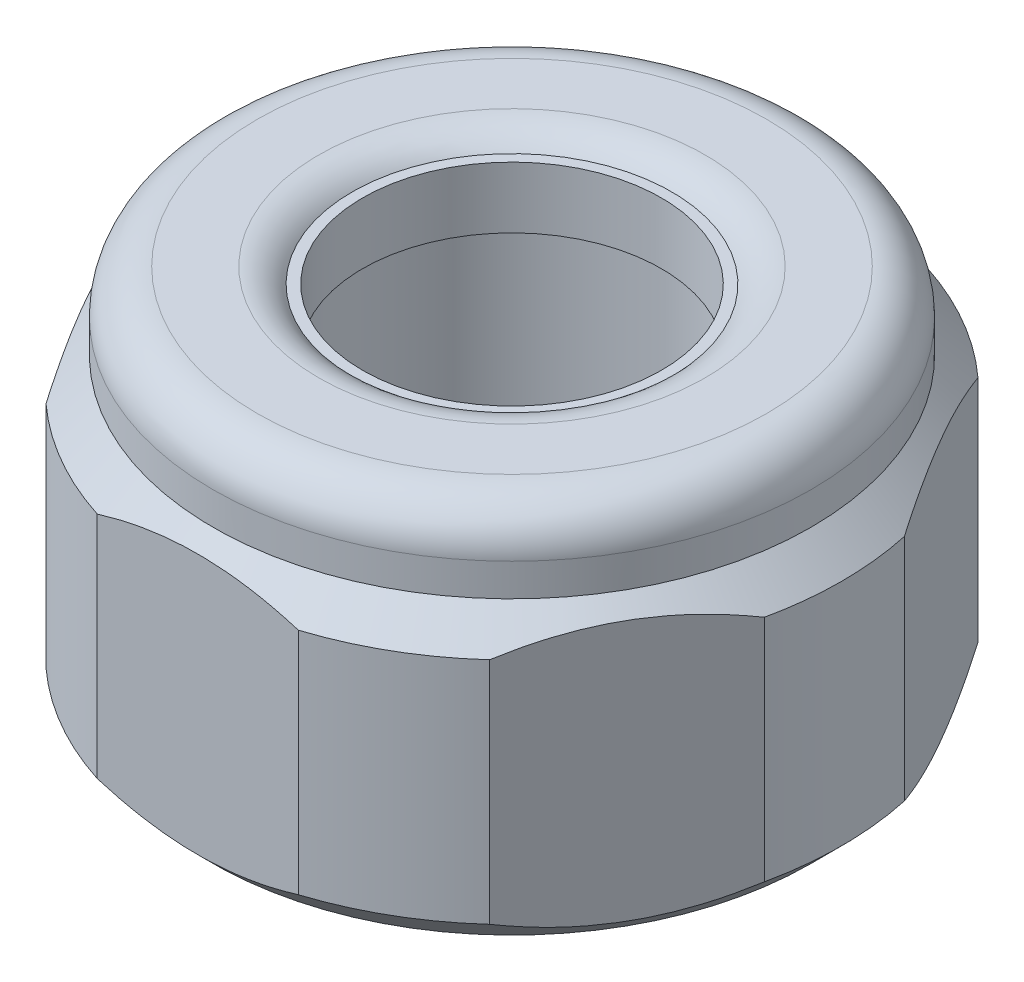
ISO-10303-21;
HEADER;
FILE_DESCRIPTION(('STEP AP214'),'2;1');
FILE_NAME('part.step','',(''),(''),'','','');
FILE_SCHEMA(('AUTOMOTIVE_DESIGN { 1 0 10303 214 1 1 1 1 }'));
ENDSEC;
DATA;
#1=APPLICATION_CONTEXT('core data for automotive mechanical design processes');
#2=APPLICATION_PROTOCOL_DEFINITION('international standard','automotive_design',2000,#1);
#3=PRODUCT_CONTEXT('',#1,'mechanical');
#4=PRODUCT('Part','Part','',(#3));
#5=PRODUCT_RELATED_PRODUCT_CATEGORY('part','',(#4));
#6=PRODUCT_DEFINITION_FORMATION('','',#4);
#7=PRODUCT_DEFINITION_CONTEXT('part definition',#1,'design');
#8=PRODUCT_DEFINITION('design','',#6,#7);
#9=PRODUCT_DEFINITION_SHAPE('','',#8);
#10=(LENGTH_UNIT() NAMED_UNIT(*) SI_UNIT(.MILLI.,.METRE.));
#11=(NAMED_UNIT(*) PLANE_ANGLE_UNIT() SI_UNIT($,.RADIAN.));
#12=(NAMED_UNIT(*) SI_UNIT($,.STERADIAN.) SOLID_ANGLE_UNIT());
#13=UNCERTAINTY_MEASURE_WITH_UNIT(LENGTH_MEASURE(1.E-05),#10,'distance_accuracy_value','');
#14=(GEOMETRIC_REPRESENTATION_CONTEXT(3) GLOBAL_UNCERTAINTY_ASSIGNED_CONTEXT((#13)) GLOBAL_UNIT_ASSIGNED_CONTEXT((#10,
#11,#12)) REPRESENTATION_CONTEXT('',''));
#15=CARTESIAN_POINT('',(0.,0.,0.));
#16=DIRECTION('',(0.,0.,1.));
#17=DIRECTION('',(1.,0.,0.));
#18=AXIS2_PLACEMENT_3D('',#15,#16,#17);
#19=CARTESIAN_POINT('',(0.,1.06572779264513,0.));
#20=DIRECTION('',(0.,-1.,0.));
#21=DIRECTION('',(1.,0.,0.));
#22=AXIS2_PLACEMENT_3D('',#19,#20,#21);
#23=CONICAL_SURFACE('',#22,4.73427220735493,0.785398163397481);
#24=CARTESIAN_POINT('',(0.,1.90000000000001,0.));
#25=DIRECTION('',(0.,-1.,0.));
#26=DIRECTION('',(1.,0.,0.));
#27=AXIS2_PLACEMENT_3D('',#24,#25,#26);
#28=CIRCLE('',#27,3.89999999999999);
#29=CARTESIAN_POINT('',(3.89999999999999,1.90000000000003,0.));
#30=VERTEX_POINT('',#29);
#31=EDGE_CURVE('E284',#30,#30,#28,.T.);
#32=ORIENTED_EDGE('',*,*,#31,.T.);
#33=EDGE_LOOP('',(#32));
#34=FACE_BOUND('',#33,.T.);
#35=CARTESIAN_POINT('',(4.73438767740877,1.06561231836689,0.000199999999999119));
#36=CARTESIAN_POINT('',(4.69368427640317,1.10631144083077,-0.0703003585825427));
#37=CARTESIAN_POINT('',(4.65266939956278,1.14576193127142,-0.141340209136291));
#38=CARTESIAN_POINT('',(4.56995253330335,1.22178504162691,-0.284610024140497));
#39=CARTESIAN_POINT('',(4.5282501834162,1.25835608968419,-0.356840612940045));
#40=CARTESIAN_POINT('',(4.4016281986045,1.36349105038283,-0.576156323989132));
#41=CARTESIAN_POINT('',(4.31563240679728,1.42702821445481,-0.725105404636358));
#42=CARTESIAN_POINT('',(4.14224862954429,1.53583888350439,-1.02541491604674));
#43=CARTESIAN_POINT('',(4.05490443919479,1.58138639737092,-1.17669949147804));
#44=CARTESIAN_POINT('',(3.87828737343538,1.65156787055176,-1.48260922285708));
#45=CARTESIAN_POINT('',(3.78901990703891,1.6762541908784,-1.6372250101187));
#46=CARTESIAN_POINT('',(3.63517080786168,1.69852708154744,-1.90369946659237));
#47=CARTESIAN_POINT('',(3.57078739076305,1.70182341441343,-2.0152148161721));
#48=CARTESIAN_POINT('',(3.44212505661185,1.69626668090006,-2.23806451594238));
#49=CARTESIAN_POINT('',(3.377846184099,1.68740935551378,-2.34939878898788));
#50=CARTESIAN_POINT('',(3.24989749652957,1.65805052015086,-2.57101241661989));
#51=CARTESIAN_POINT('',(3.18622844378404,1.63753598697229,-2.68129045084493));
#52=CARTESIAN_POINT('',(3.05998381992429,1.5859825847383,-2.89995255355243));
#53=CARTESIAN_POINT('',(2.99740816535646,1.55494452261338,-3.00833676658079));
#54=CARTESIAN_POINT('',(2.88632160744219,1.49108708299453,-3.20074432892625));
#55=CARTESIAN_POINT('',(2.83756475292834,1.45994671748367,-3.28519367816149));
#56=CARTESIAN_POINT('',(2.74092631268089,1.39264751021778,-3.45257636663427));
#57=CARTESIAN_POINT('',(2.69304475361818,1.35648851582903,-3.5355096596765));
#58=CARTESIAN_POINT('',(2.59830776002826,1.27996263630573,-3.69959894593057));
#59=CARTESIAN_POINT('',(2.55144963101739,1.23960898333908,-3.78075960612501));
#60=CARTESIAN_POINT('',(2.45860112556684,1.155223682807,-3.94157793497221));
#61=CARTESIAN_POINT('',(2.4126102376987,1.11119429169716,-4.02123648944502));
#62=CARTESIAN_POINT('',(2.36702063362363,1.06561231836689,-4.1002));
#63=B_SPLINE_CURVE_WITH_KNOTS('',3,(#35,#36,#37,#38,#39,#40,#41,#42,#43,#44,#45,#46,#47,#48,#49,
#50,#51,#52,#53,#54,#55,#56,#57,#58,#59,#60,#61,#62),.UNSPECIFIED.,.F.,.F.,(4,2,2,2,2,2,2,2,2,2,
2,2,2,4),(0.,0.273020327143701,0.546188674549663,1.09547485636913,1.63603822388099,
2.17524072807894,2.56112268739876,2.94713990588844,3.33358922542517,3.72000891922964,
4.02696073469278,4.33392188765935,4.63994253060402,4.94577667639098),.UNSPECIFIED.);
#64=CARTESIAN_POINT('',(4.20702438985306,1.49500000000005,-0.91322000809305));
#65=VERTEX_POINT('',#64);
#66=CARTESIAN_POINT('',(2.89438392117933,1.49500000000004,-3.18677999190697));
#67=VERTEX_POINT('',#66);
#68=EDGE_CURVE('E230',#65,#67,#63,.T.);
#69=ORIENTED_EDGE('',*,*,#68,.T.);
#70=CARTESIAN_POINT('',(0.,1.49500000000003,0.));
#71=DIRECTION('',(0.,-1.,0.));
#72=DIRECTION('',(1.,0.,0.));
#73=AXIS2_PLACEMENT_3D('',#70,#71,#72);
#74=CIRCLE('',#73,4.305);
#75=CARTESIAN_POINT('',(1.31264046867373,1.49500000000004,-4.1));
#76=VERTEX_POINT('',#75);
#77=EDGE_CURVE('E272',#67,#76,#74,.F.);
#78=ORIENTED_EDGE('',*,*,#77,.T.);
#79=CARTESIAN_POINT('',(-4.85965164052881,-0.558161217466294,-4.1));
#80=CARTESIAN_POINT('',(-4.74192837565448,-0.468203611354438,-4.1));
#81=CARTESIAN_POINT('',(-4.62356174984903,-0.379074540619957,-4.1));
#82=CARTESIAN_POINT('',(-4.38528211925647,-0.202849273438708,-4.1));
#83=CARTESIAN_POINT('',(-4.26536874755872,-0.115753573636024,-4.1));
#84=CARTESIAN_POINT('',(-4.02285896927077,0.0566490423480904,-4.1));
#85=CARTESIAN_POINT('',(-3.90024898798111,0.141936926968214,-4.1));
#86=CARTESIAN_POINT('',(-3.65297313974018,0.309468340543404,-4.1));
#87=CARTESIAN_POINT('',(-3.52830741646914,0.39171208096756,-4.1));
#88=CARTESIAN_POINT('',(-3.268890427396,0.557378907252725,-4.1));
#89=CARTESIAN_POINT('',(-3.13398834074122,0.640567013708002,-4.1));
#90=CARTESIAN_POINT('',(-2.86102203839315,0.801669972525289,-4.1));
#91=CARTESIAN_POINT('',(-2.72295730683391,0.879583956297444,-4.1));
#92=CARTESIAN_POINT('',(-2.44364631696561,1.02847130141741,-4.1));
#93=CARTESIAN_POINT('',(-2.30241101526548,1.09946505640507,-4.1));
#94=CARTESIAN_POINT('',(-2.01599787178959,1.23292169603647,-4.1));
#95=CARTESIAN_POINT('',(-1.87082190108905,1.29538854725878,-4.1));
#96=CARTESIAN_POINT('',(-1.58983505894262,1.4042751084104,-4.1));
#97=CARTESIAN_POINT('',(-1.45439563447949,1.45164354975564,-4.1));
#98=CARTESIAN_POINT('',(-1.18013478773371,1.53553167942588,-4.1));
#99=CARTESIAN_POINT('',(-1.04131314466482,1.57205065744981,-4.1));
#100=CARTESIAN_POINT('',(-0.76349423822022,1.63168098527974,-4.1));
#101=CARTESIAN_POINT('',(-0.624549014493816,1.65503076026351,-4.1));
#102=CARTESIAN_POINT('',(-0.345019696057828,1.68784725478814,-4.1));
#103=CARTESIAN_POINT('',(-0.20443592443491,1.6973166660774,-4.1));
#104=CARTESIAN_POINT('',(0.0712088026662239,1.70160309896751,-4.1));
#105=CARTESIAN_POINT('',(0.206260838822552,1.69700270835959,-4.1));
#106=CARTESIAN_POINT('',(0.475274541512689,1.67472344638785,-4.1));
#107=CARTESIAN_POINT('',(0.609236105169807,1.6570433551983,-4.1));
#108=CARTESIAN_POINT('',(0.877367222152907,1.60929098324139,-4.1));
#109=CARTESIAN_POINT('',(1.0114976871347,1.57900283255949,-4.1));
#110=CARTESIAN_POINT('',(1.27681712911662,1.50769083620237,-4.1));
#111=CARTESIAN_POINT('',(1.40800630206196,1.46666770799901,-4.1));
#112=CARTESIAN_POINT('',(1.67628366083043,1.37246643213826,-4.1));
#113=CARTESIAN_POINT('',(1.81314098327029,1.31863794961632,-4.1));
#114=CARTESIAN_POINT('',(2.0833244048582,1.20268139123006,-4.1));
#115=CARTESIAN_POINT('',(2.21664886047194,1.14054953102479,-4.1));
#116=CARTESIAN_POINT('',(2.48040337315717,1.00946107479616,-4.1));
#117=CARTESIAN_POINT('',(2.61082282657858,0.94048331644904,-4.1));
#118=CARTESIAN_POINT('',(2.86866911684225,0.797223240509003,-4.1));
#119=CARTESIAN_POINT('',(2.99609641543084,0.722941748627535,-4.1));
#120=CARTESIAN_POINT('',(3.24210976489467,0.573894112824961,-4.1));
#121=CARTESIAN_POINT('',(3.36082125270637,0.499333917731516,-4.1));
#122=CARTESIAN_POINT('',(3.59620511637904,0.347051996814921,-4.1));
#123=CARTESIAN_POINT('',(3.7128773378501,0.269330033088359,-4.1));
#124=CARTESIAN_POINT('',(3.94350868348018,0.111924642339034,-4.1));
#125=CARTESIAN_POINT('',(4.05748209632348,0.0322620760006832,-4.1));
#126=CARTESIAN_POINT('',(4.28386722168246,-0.129189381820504,-4.1));
#127=CARTESIAN_POINT('',(4.39627935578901,-0.210977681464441,-4.1));
#128=CARTESIAN_POINT('',(4.50803692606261,-0.293635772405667,-4.1));
#129=B_SPLINE_CURVE_WITH_KNOTS('',3,(#79,#80,#81,#82,#83,#84,#85,#86,#87,#88,#89,#90,#91,#92,
#93,#94,#95,#96,#97,#98,#99,#100,#101,#102,#103,#104,#105,#106,#107,#108,#109,#110,#111,#112,
#113,#114,#115,#116,#117,#118,#119,#120,#121,#122,#123,#124,#125,#126,#127,#128),.UNSPECIFIED.,
.F.,.F.,(4,2,2,2,2,2,2,2,2,2,2,2,2,2,2,2,2,2,2,2,2,2,2,2,4),(0.,0.444485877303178,
0.889079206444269,1.33710924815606,1.78510810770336,2.26047991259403,2.73592981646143,
3.20993330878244,3.6837155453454,4.11379352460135,4.543899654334,4.96594590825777,
5.38791030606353,5.79264233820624,6.19741212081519,6.60941745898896,7.0213952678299,
7.46224346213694,7.90329326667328,8.34575164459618,8.78814128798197,9.20863544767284,
9.62916130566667,10.0462974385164,10.4633186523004),.UNSPECIFIED.);
#130=CARTESIAN_POINT('',(-1.31264046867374,1.49500000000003,-4.1));
#131=VERTEX_POINT('',#130);
#132=EDGE_CURVE('E222',#76,#131,#129,.F.);
#133=ORIENTED_EDGE('',*,*,#132,.T.);
#134=CARTESIAN_POINT('',(-2.89438392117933,1.49500000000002,-3.18677999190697));
#135=VERTEX_POINT('',#134);
#136=EDGE_CURVE('E268',#131,#135,#74,.F.);
#137=ORIENTED_EDGE('',*,*,#136,.T.);
#138=CARTESIAN_POINT('',(-2.36702063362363,1.06561231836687,-4.1002));
#139=CARTESIAN_POINT('',(-2.40772403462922,1.10631144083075,-4.02969964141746));
#140=CARTESIAN_POINT('',(-2.44873891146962,1.1457619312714,-3.95865979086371));
#141=CARTESIAN_POINT('',(-2.53145577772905,1.22178504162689,-3.8153899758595));
#142=CARTESIAN_POINT('',(-2.57315812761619,1.25835608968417,-3.74315938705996));
#143=CARTESIAN_POINT('',(-2.6997801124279,1.36349105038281,-3.52384367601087));
#144=CARTESIAN_POINT('',(-2.78577590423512,1.42702821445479,-3.37489459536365));
#145=CARTESIAN_POINT('',(-2.95915968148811,1.53583888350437,-3.07458508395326));
#146=CARTESIAN_POINT('',(-3.04650387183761,1.5813863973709,-2.92330050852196));
#147=CARTESIAN_POINT('',(-3.22312093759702,1.65156787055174,-2.61739077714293));
#148=CARTESIAN_POINT('',(-3.31238840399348,1.67625419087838,-2.4627749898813));
#149=CARTESIAN_POINT('',(-3.46623750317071,1.69852708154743,-2.19630053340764));
#150=CARTESIAN_POINT('',(-3.53062092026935,1.70182341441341,-2.08478518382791));
#151=CARTESIAN_POINT('',(-3.65928325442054,1.69626668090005,-1.86193548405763));
#152=CARTESIAN_POINT('',(-3.7235621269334,1.68740935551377,-1.75060121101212));
#153=CARTESIAN_POINT('',(-3.85151081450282,1.65805052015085,-1.52898758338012));
#154=CARTESIAN_POINT('',(-3.91517986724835,1.63753598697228,-1.41870954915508));
#155=CARTESIAN_POINT('',(-4.0414244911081,1.58598258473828,-1.20004744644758));
#156=CARTESIAN_POINT('',(-4.10400014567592,1.55494452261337,-1.09166323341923));
#157=CARTESIAN_POINT('',(-4.2150867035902,1.49108708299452,-0.899255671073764));
#158=CARTESIAN_POINT('',(-4.26384355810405,1.45994671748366,-0.814806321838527));
#159=CARTESIAN_POINT('',(-4.36048199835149,1.39264751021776,-0.647423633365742));
#160=CARTESIAN_POINT('',(-4.40836355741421,1.35648851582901,-0.564490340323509));
#161=CARTESIAN_POINT('',(-4.50310055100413,1.27996263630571,-0.400401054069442));
#162=CARTESIAN_POINT('',(-4.549958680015,1.23960898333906,-0.319240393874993));
#163=CARTESIAN_POINT('',(-4.64280718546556,1.15522368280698,-0.158422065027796));
#164=CARTESIAN_POINT('',(-4.68879807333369,1.11119429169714,-0.0787635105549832));
#165=CARTESIAN_POINT('',(-4.73438767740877,1.06561231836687,0.000199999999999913));
#166=B_SPLINE_CURVE_WITH_KNOTS('',3,(#138,#139,#140,#141,#142,#143,#144,#145,#146,#147,#148,
#149,#150,#151,#152,#153,#154,#155,#156,#157,#158,#159,#160,#161,#162,#163,#164,#165),
.UNSPECIFIED.,.F.,.F.,(4,2,2,2,2,2,2,2,2,2,2,2,2,4),(0.,0.2730203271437,0.546188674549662,
1.09547485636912,1.63603822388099,2.17524072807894,2.56112268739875,2.94713990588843,
3.33358922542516,3.72000891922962,4.02696073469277,4.33392188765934,4.63994253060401,
4.94577667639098),.UNSPECIFIED.);
#167=CARTESIAN_POINT('',(-4.20702438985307,1.49500000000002,-0.913220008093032));
#168=VERTEX_POINT('',#167);
#169=EDGE_CURVE('E231',#135,#168,#166,.T.);
#170=ORIENTED_EDGE('',*,*,#169,.T.);
#171=CARTESIAN_POINT('',(-4.20702438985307,1.49500000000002,0.913220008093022));
#172=VERTEX_POINT('',#171);
#173=EDGE_CURVE('E58',#168,#172,#74,.F.);
#174=ORIENTED_EDGE('',*,*,#173,.T.);
#175=CARTESIAN_POINT('',(-4.73438767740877,1.06561231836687,-0.000200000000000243));
#176=CARTESIAN_POINT('',(-4.69368427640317,1.10631144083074,0.0703003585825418));
#177=CARTESIAN_POINT('',(-4.65266939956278,1.14576193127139,0.14134020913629));
#178=CARTESIAN_POINT('',(-4.56995253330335,1.22178504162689,0.284610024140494));
#179=CARTESIAN_POINT('',(-4.52825018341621,1.25835608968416,0.356840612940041));
#180=CARTESIAN_POINT('',(-4.4016281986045,1.36349105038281,0.576156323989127));
#181=CARTESIAN_POINT('',(-4.31563240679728,1.42702821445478,0.725105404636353));
#182=CARTESIAN_POINT('',(-4.14224862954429,1.53583888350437,1.02541491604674));
#183=CARTESIAN_POINT('',(-4.05490443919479,1.5813863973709,1.17669949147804));
#184=CARTESIAN_POINT('',(-3.87828737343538,1.65156787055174,1.48260922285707));
#185=CARTESIAN_POINT('',(-3.78901990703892,1.67625419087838,1.63722501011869));
#186=CARTESIAN_POINT('',(-3.63517080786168,1.69852708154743,1.90369946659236));
#187=CARTESIAN_POINT('',(-3.57078739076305,1.70182341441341,2.01521481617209));
#188=CARTESIAN_POINT('',(-3.44212505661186,1.69626668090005,2.23806451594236));
#189=CARTESIAN_POINT('',(-3.377846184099,1.68740935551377,2.34939878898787));
#190=CARTESIAN_POINT('',(-3.24989749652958,1.65805052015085,2.57101241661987));
#191=CARTESIAN_POINT('',(-3.18622844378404,1.63753598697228,2.68129045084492));
#192=CARTESIAN_POINT('',(-3.0599838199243,1.58598258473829,2.89995255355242));
#193=CARTESIAN_POINT('',(-2.99740816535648,1.55494452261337,3.00833676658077));
#194=CARTESIAN_POINT('',(-2.8863216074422,1.49108708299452,3.20074432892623));
#195=CARTESIAN_POINT('',(-2.83756475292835,1.45994671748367,3.28519367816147));
#196=CARTESIAN_POINT('',(-2.7409263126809,1.39264751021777,3.45257636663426));
#197=CARTESIAN_POINT('',(-2.69304475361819,1.35648851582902,3.53550965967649));
#198=CARTESIAN_POINT('',(-2.59830776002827,1.27996263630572,3.69959894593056));
#199=CARTESIAN_POINT('',(-2.5514496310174,1.23960898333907,3.78075960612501));
#200=CARTESIAN_POINT('',(-2.45860112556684,1.15522368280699,3.9415779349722));
#201=CARTESIAN_POINT('',(-2.41261023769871,1.11119429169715,4.02123648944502));
#202=CARTESIAN_POINT('',(-2.36702063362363,1.06561231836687,4.1002));
#203=B_SPLINE_CURVE_WITH_KNOTS('',3,(#175,#176,#177,#178,#179,#180,#181,#182,#183,#184,#185,
#186,#187,#188,#189,#190,#191,#192,#193,#194,#195,#196,#197,#198,#199,#200,#201,#202),
.UNSPECIFIED.,.F.,.F.,(4,2,2,2,2,2,2,2,2,2,2,2,2,4),(0.,0.2730203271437,0.546188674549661,
1.09547485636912,1.63603822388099,2.17524072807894,2.56112268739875,2.94713990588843,
3.33358922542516,3.72000891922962,4.02696073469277,4.33392188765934,4.63994253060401,
4.94577667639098),.UNSPECIFIED.);
#204=CARTESIAN_POINT('',(-2.89438392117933,1.49500000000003,3.18677999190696));
#205=VERTEX_POINT('',#204);
#206=EDGE_CURVE('E295',#172,#205,#203,.T.);
#207=ORIENTED_EDGE('',*,*,#206,.T.);
#208=CARTESIAN_POINT('',(-1.31264046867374,1.49500000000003,4.1));
#209=VERTEX_POINT('',#208);
#210=EDGE_CURVE('E50',#205,#209,#74,.F.);
#211=ORIENTED_EDGE('',*,*,#210,.T.);
#212=CARTESIAN_POINT('',(-4.8596516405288,-0.558161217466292,4.1));
#213=CARTESIAN_POINT('',(-4.74192837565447,-0.468203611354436,4.1));
#214=CARTESIAN_POINT('',(-4.62356174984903,-0.379074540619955,4.1));
#215=CARTESIAN_POINT('',(-4.38528211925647,-0.202849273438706,4.1));
#216=CARTESIAN_POINT('',(-4.26536874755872,-0.115753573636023,4.1));
#217=CARTESIAN_POINT('',(-4.02285896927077,0.0566490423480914,4.1));
#218=CARTESIAN_POINT('',(-3.90024898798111,0.141936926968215,4.1));
#219=CARTESIAN_POINT('',(-3.65297313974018,0.309468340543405,4.1));
#220=CARTESIAN_POINT('',(-3.52830741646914,0.39171208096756,4.1));
#221=CARTESIAN_POINT('',(-3.268890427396,0.557378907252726,4.1));
#222=CARTESIAN_POINT('',(-3.13398834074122,0.640567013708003,4.1));
#223=CARTESIAN_POINT('',(-2.86102203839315,0.80166997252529,4.1));
#224=CARTESIAN_POINT('',(-2.72295730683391,0.879583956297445,4.1));
#225=CARTESIAN_POINT('',(-2.44364631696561,1.02847130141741,4.1));
#226=CARTESIAN_POINT('',(-2.30241101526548,1.09946505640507,4.1));
#227=CARTESIAN_POINT('',(-2.01599787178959,1.23292169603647,4.1));
#228=CARTESIAN_POINT('',(-1.87082190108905,1.29538854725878,4.1));
#229=CARTESIAN_POINT('',(-1.58983505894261,1.4042751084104,4.1));
#230=CARTESIAN_POINT('',(-1.45439563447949,1.45164354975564,4.1));
#231=CARTESIAN_POINT('',(-1.18013478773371,1.53553167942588,4.1));
#232=CARTESIAN_POINT('',(-1.04131314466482,1.57205065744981,4.1));
#233=CARTESIAN_POINT('',(-0.763494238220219,1.63168098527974,4.1));
#234=CARTESIAN_POINT('',(-0.624549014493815,1.65503076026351,4.1));
#235=CARTESIAN_POINT('',(-0.345019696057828,1.68784725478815,4.1));
#236=CARTESIAN_POINT('',(-0.20443592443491,1.6973166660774,4.1));
#237=CARTESIAN_POINT('',(0.0712088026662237,1.70160309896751,4.1));
#238=CARTESIAN_POINT('',(0.206260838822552,1.69700270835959,4.1));
#239=CARTESIAN_POINT('',(0.475274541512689,1.67472344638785,4.1));
#240=CARTESIAN_POINT('',(0.609236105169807,1.6570433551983,4.1));
#241=CARTESIAN_POINT('',(0.877367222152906,1.6092909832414,4.1));
#242=CARTESIAN_POINT('',(1.0114976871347,1.57900283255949,4.1));
#243=CARTESIAN_POINT('',(1.27681712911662,1.50769083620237,4.1));
#244=CARTESIAN_POINT('',(1.40800630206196,1.46666770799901,4.1));
#245=CARTESIAN_POINT('',(1.67628366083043,1.37246643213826,4.1));
#246=CARTESIAN_POINT('',(1.81314098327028,1.31863794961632,4.1));
#247=CARTESIAN_POINT('',(2.08332440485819,1.20268139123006,4.1));
#248=CARTESIAN_POINT('',(2.21664886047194,1.1405495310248,4.1));
#249=CARTESIAN_POINT('',(2.48040337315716,1.00946107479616,4.1));
#250=CARTESIAN_POINT('',(2.61082282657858,0.940483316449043,4.1));
#251=CARTESIAN_POINT('',(2.86866911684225,0.797223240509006,4.1));
#252=CARTESIAN_POINT('',(2.99609641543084,0.722941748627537,4.1));
#253=CARTESIAN_POINT('',(3.24210976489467,0.573894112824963,4.1));
#254=CARTESIAN_POINT('',(3.36082125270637,0.499333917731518,4.1));
#255=CARTESIAN_POINT('',(3.59620511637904,0.347051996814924,4.1));
#256=CARTESIAN_POINT('',(3.7128773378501,0.269330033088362,4.1));
#257=CARTESIAN_POINT('',(3.94350868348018,0.111924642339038,4.1));
#258=CARTESIAN_POINT('',(4.05748209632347,0.0322620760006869,4.1));
#259=CARTESIAN_POINT('',(4.28386722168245,-0.1291893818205,4.1));
#260=CARTESIAN_POINT('',(4.396279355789,-0.210977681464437,4.1));
#261=CARTESIAN_POINT('',(4.5080369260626,-0.293635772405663,4.1));
#262=B_SPLINE_CURVE_WITH_KNOTS('',3,(#212,#213,#214,#215,#216,#217,#218,#219,#220,#221,#222,
#223,#224,#225,#226,#227,#228,#229,#230,#231,#232,#233,#234,#235,#236,#237,#238,#239,#240,#241,
#242,#243,#244,#245,#246,#247,#248,#249,#250,#251,#252,#253,#254,#255,#256,#257,#258,#259,#260,
#261),.UNSPECIFIED.,.F.,.F.,(4,2,2,2,2,2,2,2,2,2,2,2,2,2,2,2,2,2,2,2,2,2,2,2,4),(0.,
0.444485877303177,0.889079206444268,1.33710924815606,1.78510810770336,2.26047991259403,
2.73592981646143,3.20993330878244,3.6837155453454,4.11379352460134,4.543899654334,
4.96594590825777,5.38791030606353,5.79264233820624,6.19741212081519,6.60941745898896,
7.0213952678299,7.46224346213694,7.90329326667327,8.34575164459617,8.78814128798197,
9.20863544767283,9.62916130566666,10.0462974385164,10.4633186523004),.UNSPECIFIED.);
#263=CARTESIAN_POINT('',(1.31264046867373,1.49500000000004,4.1));
#264=VERTEX_POINT('',#263);
#265=EDGE_CURVE('E287',#209,#264,#262,.T.);
#266=ORIENTED_EDGE('',*,*,#265,.T.);
#267=CARTESIAN_POINT('',(2.89438392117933,1.49500000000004,3.18677999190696));
#268=VERTEX_POINT('',#267);
#269=EDGE_CURVE('E333',#264,#268,#74,.F.);
#270=ORIENTED_EDGE('',*,*,#269,.T.);
#271=CARTESIAN_POINT('',(2.36702063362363,1.06561231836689,4.1002));
#272=CARTESIAN_POINT('',(2.40772403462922,1.10631144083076,4.02969964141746));
#273=CARTESIAN_POINT('',(2.44873891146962,1.14576193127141,3.95865979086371));
#274=CARTESIAN_POINT('',(2.53145577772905,1.22178504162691,3.8153899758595));
#275=CARTESIAN_POINT('',(2.57315812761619,1.25835608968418,3.74315938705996));
#276=CARTESIAN_POINT('',(2.6997801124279,1.36349105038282,3.52384367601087));
#277=CARTESIAN_POINT('',(2.78577590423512,1.4270282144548,3.37489459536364));
#278=CARTESIAN_POINT('',(2.95915968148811,1.53583888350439,3.07458508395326));
#279=CARTESIAN_POINT('',(3.04650387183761,1.58138639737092,2.92330050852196));
#280=CARTESIAN_POINT('',(3.22312093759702,1.65156787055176,2.61739077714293));
#281=CARTESIAN_POINT('',(3.31238840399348,1.6762541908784,2.4627749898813));
#282=CARTESIAN_POINT('',(3.46623750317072,1.69852708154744,2.19630053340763));
#283=CARTESIAN_POINT('',(3.53062092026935,1.70182341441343,2.0847851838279));
#284=CARTESIAN_POINT('',(3.65928325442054,1.69626668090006,1.86193548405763));
#285=CARTESIAN_POINT('',(3.7235621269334,1.68740935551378,1.75060121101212));
#286=CARTESIAN_POINT('',(3.85151081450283,1.65805052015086,1.52898758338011));
#287=CARTESIAN_POINT('',(3.91517986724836,1.63753598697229,1.41870954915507));
#288=CARTESIAN_POINT('',(4.0414244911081,1.5859825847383,1.20004744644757));
#289=CARTESIAN_POINT('',(4.10400014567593,1.55494452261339,1.09166323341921));
#290=CARTESIAN_POINT('',(4.2150867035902,1.49108708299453,0.899255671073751));
#291=CARTESIAN_POINT('',(4.26384355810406,1.45994671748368,0.814806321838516));
#292=CARTESIAN_POINT('',(4.3604819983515,1.39264751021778,0.647423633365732));
#293=CARTESIAN_POINT('',(4.40836355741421,1.35648851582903,0.564490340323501));
#294=CARTESIAN_POINT('',(4.50310055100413,1.27996263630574,0.400401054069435));
#295=CARTESIAN_POINT('',(4.549958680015,1.23960898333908,0.319240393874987));
#296=CARTESIAN_POINT('',(4.64280718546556,1.15522368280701,0.158422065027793));
#297=CARTESIAN_POINT('',(4.68879807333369,1.11119429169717,0.0787635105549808));
#298=CARTESIAN_POINT('',(4.73438767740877,1.06561231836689,-0.000200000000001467));
#299=B_SPLINE_CURVE_WITH_KNOTS('',3,(#271,#272,#273,#274,#275,#276,#277,#278,#279,#280,#281,
#282,#283,#284,#285,#286,#287,#288,#289,#290,#291,#292,#293,#294,#295,#296,#297,#298),
.UNSPECIFIED.,.F.,.F.,(4,2,2,2,2,2,2,2,2,2,2,2,2,4),(0.,0.2730203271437,0.546188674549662,
1.09547485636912,1.63603822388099,2.17524072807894,2.56112268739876,2.94713990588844,
3.33358922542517,3.72000891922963,4.02696073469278,4.33392188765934,4.63994253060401,
4.94577667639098),.UNSPECIFIED.);
#300=CARTESIAN_POINT('',(4.20702438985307,1.49500000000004,0.913220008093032));
#301=VERTEX_POINT('',#300);
#302=EDGE_CURVE('E242',#268,#301,#299,.T.);
#303=ORIENTED_EDGE('',*,*,#302,.T.);
#304=EDGE_CURVE('E127',#301,#65,#74,.F.);
#305=ORIENTED_EDGE('',*,*,#304,.T.);
#306=EDGE_LOOP('',(#69,#78,#133,#137,#170,#174,#207,#211,#266,#270,#303,#305));
#307=FACE_BOUND('',#306,.T.);
#308=ADVANCED_FACE('F35',(#34,#307),#23,.T.);
#309=CARTESIAN_POINT('',(0.,-1.8999999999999,0.));
#310=DIRECTION('',(0.,1.,0.));
#311=DIRECTION('',(-1.,0.,0.));
#312=AXIS2_PLACEMENT_3D('',#309,#310,#311);
#313=CONICAL_SURFACE('',#312,3.90000000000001,0.785398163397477);
#314=CARTESIAN_POINT('',(0.,-1.8999999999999,0.));
#315=DIRECTION('',(0.,-1.,0.));
#316=DIRECTION('',(1.,0.,0.));
#317=AXIS2_PLACEMENT_3D('',#314,#315,#316);
#318=CIRCLE('',#317,3.90000000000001);
#319=CARTESIAN_POINT('',(3.90000000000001,-1.89999999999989,0.));
#320=VERTEX_POINT('',#319);
#321=EDGE_CURVE('E283',#320,#320,#318,.T.);
#322=ORIENTED_EDGE('',*,*,#321,.F.);
#323=EDGE_LOOP('',(#322));
#324=FACE_BOUND('',#323,.T.);
#325=CARTESIAN_POINT('',(-4.73438767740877,-1.06561231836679,0.00019999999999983));
#326=CARTESIAN_POINT('',(-4.69368427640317,-1.10631144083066,-0.0703003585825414));
#327=CARTESIAN_POINT('',(-4.65266939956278,-1.14576193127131,-0.141340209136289));
#328=CARTESIAN_POINT('',(-4.56995253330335,-1.22178504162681,-0.284610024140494));
#329=CARTESIAN_POINT('',(-4.52825018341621,-1.25835608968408,-0.356840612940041));
#330=CARTESIAN_POINT('',(-4.4016281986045,-1.36349105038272,-0.576156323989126));
#331=CARTESIAN_POINT('',(-4.31563240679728,-1.4270282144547,-0.725105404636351));
#332=CARTESIAN_POINT('',(-4.14224862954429,-1.53583888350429,-1.02541491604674));
#333=CARTESIAN_POINT('',(-4.05490443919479,-1.58138639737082,-1.17669949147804));
#334=CARTESIAN_POINT('',(-3.87828737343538,-1.65156787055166,-1.48260922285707));
#335=CARTESIAN_POINT('',(-3.78901990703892,-1.6762541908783,-1.63722501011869));
#336=CARTESIAN_POINT('',(-3.63517080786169,-1.69852708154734,-1.90369946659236));
#337=CARTESIAN_POINT('',(-3.57078739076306,-1.70182341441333,-2.01521481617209));
#338=CARTESIAN_POINT('',(-3.44212505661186,-1.69626668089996,-2.23806451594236));
#339=CARTESIAN_POINT('',(-3.37784618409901,-1.68740935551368,-2.34939878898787));
#340=CARTESIAN_POINT('',(-3.24989749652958,-1.65805052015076,-2.57101241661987));
#341=CARTESIAN_POINT('',(-3.18622844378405,-1.6375359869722,-2.68129045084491));
#342=CARTESIAN_POINT('',(-3.0599838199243,-1.5859825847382,-2.89995255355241));
#343=CARTESIAN_POINT('',(-2.99740816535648,-1.55494452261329,-3.00833676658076));
#344=CARTESIAN_POINT('',(-2.88632160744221,-1.49108708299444,-3.20074432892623));
#345=CARTESIAN_POINT('',(-2.83756475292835,-1.45994671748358,-3.28519367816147));
#346=CARTESIAN_POINT('',(-2.74092631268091,-1.39264751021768,-3.45257636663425));
#347=CARTESIAN_POINT('',(-2.69304475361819,-1.35648851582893,-3.53550965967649));
#348=CARTESIAN_POINT('',(-2.59830776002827,-1.27996263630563,-3.69959894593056));
#349=CARTESIAN_POINT('',(-2.5514496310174,-1.23960898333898,-3.780759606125));
#350=CARTESIAN_POINT('',(-2.45860112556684,-1.1552236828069,-3.9415779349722));
#351=CARTESIAN_POINT('',(-2.41261023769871,-1.11119429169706,-4.02123648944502));
#352=CARTESIAN_POINT('',(-2.36702063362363,-1.06561231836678,-4.1002));
#353=B_SPLINE_CURVE_WITH_KNOTS('',3,(#325,#326,#327,#328,#329,#330,#331,#332,#333,#334,#335,
#336,#337,#338,#339,#340,#341,#342,#343,#344,#345,#346,#347,#348,#349,#350,#351,#352),
.UNSPECIFIED.,.F.,.F.,(4,2,2,2,2,2,2,2,2,2,2,2,2,4),(0.,0.273020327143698,0.546188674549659,
1.09547485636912,1.63603822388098,2.17524072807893,2.56112268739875,2.94713990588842,
3.33358922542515,3.72000891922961,4.02696073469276,4.33392188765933,4.63994253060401,
4.94577667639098),.UNSPECIFIED.);
#354=CARTESIAN_POINT('',(-4.20702438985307,-1.49499999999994,-0.913220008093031));
#355=VERTEX_POINT('',#354);
#356=CARTESIAN_POINT('',(-2.89438392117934,-1.49499999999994,-3.18677999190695));
#357=VERTEX_POINT('',#356);
#358=EDGE_CURVE('E200',#355,#357,#353,.T.);
#359=ORIENTED_EDGE('',*,*,#358,.T.);
#360=CARTESIAN_POINT('',(0.,-1.49499999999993,0.));
#361=DIRECTION('',(0.,1.,0.));
#362=DIRECTION('',(-1.,0.,0.));
#363=AXIS2_PLACEMENT_3D('',#360,#361,#362);
#364=CIRCLE('',#363,4.305);
#365=CARTESIAN_POINT('',(-1.31264046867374,-1.49499999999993,-4.1));
#366=VERTEX_POINT('',#365);
#367=EDGE_CURVE('E257',#357,#366,#364,.F.);
#368=ORIENTED_EDGE('',*,*,#367,.T.);
#369=CARTESIAN_POINT('',(-4.85965164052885,0.558161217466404,-4.1));
#370=CARTESIAN_POINT('',(-4.74192837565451,0.468203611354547,-4.1));
#371=CARTESIAN_POINT('',(-4.62356174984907,0.379074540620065,-4.1));
#372=CARTESIAN_POINT('',(-4.38528211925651,0.202849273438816,-4.1));
#373=CARTESIAN_POINT('',(-4.26536874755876,0.115753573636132,-4.1));
#374=CARTESIAN_POINT('',(-4.0228589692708,-0.0566490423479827,-4.1));
#375=CARTESIAN_POINT('',(-3.90024898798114,-0.141936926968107,-4.1));
#376=CARTESIAN_POINT('',(-3.65297313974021,-0.309468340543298,-4.1));
#377=CARTESIAN_POINT('',(-3.52830741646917,-0.391712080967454,-4.1));
#378=CARTESIAN_POINT('',(-3.26889042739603,-0.557378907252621,-4.1));
#379=CARTESIAN_POINT('',(-3.13398834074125,-0.640567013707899,-4.1));
#380=CARTESIAN_POINT('',(-2.86102203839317,-0.801669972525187,-4.1));
#381=CARTESIAN_POINT('',(-2.72295730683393,-0.879583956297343,-4.1));
#382=CARTESIAN_POINT('',(-2.44364631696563,-1.02847130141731,-4.1));
#383=CARTESIAN_POINT('',(-2.30241101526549,-1.09946505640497,-4.1));
#384=CARTESIAN_POINT('',(-2.0159978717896,-1.23292169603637,-4.1));
#385=CARTESIAN_POINT('',(-1.87082190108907,-1.29538854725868,-4.1));
#386=CARTESIAN_POINT('',(-1.58983505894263,-1.4042751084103,-4.1));
#387=CARTESIAN_POINT('',(-1.45439563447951,-1.45164354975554,-4.1));
#388=CARTESIAN_POINT('',(-1.18013478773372,-1.53553167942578,-4.1));
#389=CARTESIAN_POINT('',(-1.04131314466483,-1.57205065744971,-4.1));
#390=CARTESIAN_POINT('',(-0.763494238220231,-1.63168098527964,-4.1));
#391=CARTESIAN_POINT('',(-0.624549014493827,-1.65503076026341,-4.1));
#392=CARTESIAN_POINT('',(-0.34501969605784,-1.68784725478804,-4.1));
#393=CARTESIAN_POINT('',(-0.204435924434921,-1.6973166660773,-4.1));
#394=CARTESIAN_POINT('',(0.0712088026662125,-1.70160309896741,-4.1));
#395=CARTESIAN_POINT('',(0.206260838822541,-1.69700270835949,-4.1));
#396=CARTESIAN_POINT('',(0.475274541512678,-1.67472344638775,-4.1));
#397=CARTESIAN_POINT('',(0.609236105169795,-1.6570433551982,-4.1));
#398=CARTESIAN_POINT('',(0.877367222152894,-1.60929098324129,-4.1));
#399=CARTESIAN_POINT('',(1.01149768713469,-1.57900283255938,-4.1));
#400=CARTESIAN_POINT('',(1.27681712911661,-1.50769083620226,-4.1));
#401=CARTESIAN_POINT('',(1.40800630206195,-1.4666677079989,-4.1));
#402=CARTESIAN_POINT('',(1.67628366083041,-1.37246643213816,-4.1));
#403=CARTESIAN_POINT('',(1.81314098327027,-1.31863794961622,-4.1));
#404=CARTESIAN_POINT('',(2.08332440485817,-1.20268139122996,-4.1));
#405=CARTESIAN_POINT('',(2.21664886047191,-1.14054953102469,-4.1));
#406=CARTESIAN_POINT('',(2.48040337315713,-1.00946107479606,-4.1));
#407=CARTESIAN_POINT('',(2.61082282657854,-0.940483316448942,-4.1));
#408=CARTESIAN_POINT('',(2.8686691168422,-0.797223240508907,-4.1));
#409=CARTESIAN_POINT('',(2.99609641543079,-0.722941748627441,-4.1));
#410=CARTESIAN_POINT('',(3.24210976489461,-0.573894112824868,-4.1));
#411=CARTESIAN_POINT('',(3.36082125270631,-0.499333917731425,-4.1));
#412=CARTESIAN_POINT('',(3.59620511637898,-0.347051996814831,-4.1));
#413=CARTESIAN_POINT('',(3.71287733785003,-0.26933003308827,-4.1));
#414=CARTESIAN_POINT('',(3.94350868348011,-0.111924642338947,-4.1));
#415=CARTESIAN_POINT('',(4.0574820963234,-0.032262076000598,-4.1));
#416=CARTESIAN_POINT('',(4.28386722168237,0.129189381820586,-4.1));
#417=CARTESIAN_POINT('',(4.39627935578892,0.210977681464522,-4.1));
#418=CARTESIAN_POINT('',(4.50803692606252,0.293635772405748,-4.1));
#419=B_SPLINE_CURVE_WITH_KNOTS('',3,(#369,#370,#371,#372,#373,#374,#375,#376,#377,#378,#379,
#380,#381,#382,#383,#384,#385,#386,#387,#388,#389,#390,#391,#392,#393,#394,#395,#396,#397,#398,
#399,#400,#401,#402,#403,#404,#405,#406,#407,#408,#409,#410,#411,#412,#413,#414,#415,#416,#417,
#418),.UNSPECIFIED.,.F.,.F.,(4,2,2,2,2,2,2,2,2,2,2,2,2,2,2,2,2,2,2,2,2,2,2,2,4),(0.,
0.444485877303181,0.889079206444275,1.33710924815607,1.78510810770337,2.26047991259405,
2.73592981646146,3.20993330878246,3.68371554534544,4.11379352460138,4.54389965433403,
4.96594590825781,5.38791030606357,5.79264233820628,6.19741212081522,6.60941745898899,
7.02139526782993,7.46224346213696,7.90329326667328,8.34575164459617,8.78814128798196,
9.20863544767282,9.62916130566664,10.0462974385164,10.4633186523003),.UNSPECIFIED.);
#420=CARTESIAN_POINT('',(1.31264046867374,-1.49499999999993,-4.1));
#421=VERTEX_POINT('',#420);
#422=EDGE_CURVE('E153',#366,#421,#419,.T.);
#423=ORIENTED_EDGE('',*,*,#422,.T.);
#424=CARTESIAN_POINT('',(2.89438392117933,-1.49499999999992,-3.18677999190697));
#425=VERTEX_POINT('',#424);
#426=EDGE_CURVE('E330',#421,#425,#364,.F.);
#427=ORIENTED_EDGE('',*,*,#426,.T.);
#428=CARTESIAN_POINT('',(2.36702063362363,-1.06561231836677,-4.1002));
#429=CARTESIAN_POINT('',(2.40772403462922,-1.10631144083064,-4.02969964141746));
#430=CARTESIAN_POINT('',(2.44873891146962,-1.14576193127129,-3.95865979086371));
#431=CARTESIAN_POINT('',(2.53145577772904,-1.22178504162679,-3.81538997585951));
#432=CARTESIAN_POINT('',(2.57315812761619,-1.25835608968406,-3.74315938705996));
#433=CARTESIAN_POINT('',(2.69978011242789,-1.36349105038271,-3.52384367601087));
#434=CARTESIAN_POINT('',(2.78577590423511,-1.42702821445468,-3.37489459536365));
#435=CARTESIAN_POINT('',(2.9591596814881,-1.53583888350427,-3.07458508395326));
#436=CARTESIAN_POINT('',(3.0465038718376,-1.5813863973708,-2.92330050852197));
#437=CARTESIAN_POINT('',(3.22312093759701,-1.65156787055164,-2.61739077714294));
#438=CARTESIAN_POINT('',(3.31238840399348,-1.67625419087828,-2.46277498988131));
#439=CARTESIAN_POINT('',(3.46623750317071,-1.69852708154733,-2.19630053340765));
#440=CARTESIAN_POINT('',(3.53062092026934,-1.70182341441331,-2.08478518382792));
#441=CARTESIAN_POINT('',(3.65928325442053,-1.69626668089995,-1.86193548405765));
#442=CARTESIAN_POINT('',(3.72356212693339,-1.68740935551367,-1.75060121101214));
#443=CARTESIAN_POINT('',(3.85151081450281,-1.65805052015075,-1.52898758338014));
#444=CARTESIAN_POINT('',(3.91517986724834,-1.63753598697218,-1.4187095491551));
#445=CARTESIAN_POINT('',(4.04142449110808,-1.58598258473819,-1.2000474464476));
#446=CARTESIAN_POINT('',(4.10400014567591,-1.55494452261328,-1.09166323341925));
#447=CARTESIAN_POINT('',(4.21508670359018,-1.49108708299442,-0.899255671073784));
#448=CARTESIAN_POINT('',(4.26384355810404,-1.45994671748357,-0.814806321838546));
#449=CARTESIAN_POINT('',(4.36048199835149,-1.39264751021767,-0.647423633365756));
#450=CARTESIAN_POINT('',(4.4083635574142,-1.35648851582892,-0.564490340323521));
#451=CARTESIAN_POINT('',(4.50310055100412,-1.27996263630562,-0.40040105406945));
#452=CARTESIAN_POINT('',(4.549958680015,-1.23960898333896,-0.319240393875));
#453=CARTESIAN_POINT('',(4.64280718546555,-1.15522368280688,-0.158422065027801));
#454=CARTESIAN_POINT('',(4.68879807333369,-1.11119429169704,-0.0787635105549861));
#455=CARTESIAN_POINT('',(4.73438767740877,-1.06561231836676,0.000199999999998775));
#456=B_SPLINE_CURVE_WITH_KNOTS('',3,(#428,#429,#430,#431,#432,#433,#434,#435,#436,#437,#438,
#439,#440,#441,#442,#443,#444,#445,#446,#447,#448,#449,#450,#451,#452,#453,#454,#455),
.UNSPECIFIED.,.F.,.F.,(4,2,2,2,2,2,2,2,2,2,2,2,2,4),(0.,0.273020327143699,0.546188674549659,
1.09547485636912,1.63603822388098,2.17524072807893,2.56112268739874,2.94713990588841,
3.33358922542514,3.7200089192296,4.02696073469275,4.33392188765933,4.63994253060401,
4.94577667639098),.UNSPECIFIED.);
#457=CARTESIAN_POINT('',(4.20702438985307,-1.49499999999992,-0.913220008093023));
#458=VERTEX_POINT('',#457);
#459=EDGE_CURVE('E142',#425,#458,#456,.T.);
#460=ORIENTED_EDGE('',*,*,#459,.T.);
#461=CARTESIAN_POINT('',(4.20702438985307,-1.49499999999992,0.913220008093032));
#462=VERTEX_POINT('',#461);
#463=EDGE_CURVE('E124',#458,#462,#364,.F.);
#464=ORIENTED_EDGE('',*,*,#463,.T.);
#465=CARTESIAN_POINT('',(4.73438767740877,-1.06561231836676,-0.000200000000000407));
#466=CARTESIAN_POINT('',(4.69368427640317,-1.10631144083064,0.0703003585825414));
#467=CARTESIAN_POINT('',(4.65266939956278,-1.14576193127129,0.141340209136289));
#468=CARTESIAN_POINT('',(4.56995253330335,-1.22178504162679,0.284610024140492));
#469=CARTESIAN_POINT('',(4.52825018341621,-1.25835608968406,0.356840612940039));
#470=CARTESIAN_POINT('',(4.4016281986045,-1.3634910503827,0.576156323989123));
#471=CARTESIAN_POINT('',(4.31563240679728,-1.42702821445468,0.725105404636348));
#472=CARTESIAN_POINT('',(4.14224862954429,-1.53583888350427,1.02541491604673));
#473=CARTESIAN_POINT('',(4.05490443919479,-1.5813863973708,1.17669949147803));
#474=CARTESIAN_POINT('',(3.87828737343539,-1.65156787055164,1.48260922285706));
#475=CARTESIAN_POINT('',(3.78901990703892,-1.67625419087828,1.63722501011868));
#476=CARTESIAN_POINT('',(3.63517080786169,-1.69852708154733,1.90369946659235));
#477=CARTESIAN_POINT('',(3.57078739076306,-1.70182341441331,2.01521481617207));
#478=CARTESIAN_POINT('',(3.44212505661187,-1.69626668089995,2.23806451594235));
#479=CARTESIAN_POINT('',(3.37784618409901,-1.68740935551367,2.34939878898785));
#480=CARTESIAN_POINT('',(3.24989749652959,-1.65805052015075,2.57101241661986));
#481=CARTESIAN_POINT('',(3.18622844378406,-1.63753598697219,2.6812904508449));
#482=CARTESIAN_POINT('',(3.05998381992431,-1.58598258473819,2.89995255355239));
#483=CARTESIAN_POINT('',(2.99740816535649,-1.55494452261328,3.00833676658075));
#484=CARTESIAN_POINT('',(2.88632160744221,-1.49108708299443,3.20074432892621));
#485=CARTESIAN_POINT('',(2.83756475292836,-1.45994671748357,3.28519367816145));
#486=CARTESIAN_POINT('',(2.74092631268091,-1.39264751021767,3.45257636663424));
#487=CARTESIAN_POINT('',(2.6930447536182,-1.35648851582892,3.53550965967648));
#488=CARTESIAN_POINT('',(2.59830776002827,-1.27996263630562,3.69959894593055));
#489=CARTESIAN_POINT('',(2.5514496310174,-1.23960898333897,3.780759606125));
#490=CARTESIAN_POINT('',(2.45860112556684,-1.15522368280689,3.9415779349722));
#491=CARTESIAN_POINT('',(2.41261023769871,-1.11119429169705,4.02123648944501));
#492=CARTESIAN_POINT('',(2.36702063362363,-1.06561231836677,4.1002));
#493=B_SPLINE_CURVE_WITH_KNOTS('',3,(#465,#466,#467,#468,#469,#470,#471,#472,#473,#474,#475,
#476,#477,#478,#479,#480,#481,#482,#483,#484,#485,#486,#487,#488,#489,#490,#491,#492),
.UNSPECIFIED.,.F.,.F.,(4,2,2,2,2,2,2,2,2,2,2,2,2,4),(0.,0.273020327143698,0.546188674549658,
1.09547485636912,1.63603822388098,2.17524072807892,2.56112268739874,2.94713990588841,
3.33358922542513,3.72000891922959,4.02696073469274,4.33392188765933,4.63994253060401,
4.94577667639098),.UNSPECIFIED.);
#494=CARTESIAN_POINT('',(2.89438392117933,-1.49499999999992,3.18677999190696));
#495=VERTEX_POINT('',#494);
#496=EDGE_CURVE('E139',#462,#495,#493,.T.);
#497=ORIENTED_EDGE('',*,*,#496,.T.);
#498=CARTESIAN_POINT('',(1.31264046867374,-1.49499999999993,4.1));
#499=VERTEX_POINT('',#498);
#500=EDGE_CURVE('E145',#495,#499,#364,.F.);
#501=ORIENTED_EDGE('',*,*,#500,.T.);
#502=CARTESIAN_POINT('',(-4.85965164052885,0.558161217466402,4.1));
#503=CARTESIAN_POINT('',(-4.74192837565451,0.468203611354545,4.1));
#504=CARTESIAN_POINT('',(-4.62356174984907,0.379074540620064,4.1));
#505=CARTESIAN_POINT('',(-4.3852821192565,0.202849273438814,4.1));
#506=CARTESIAN_POINT('',(-4.26536874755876,0.115753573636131,4.1));
#507=CARTESIAN_POINT('',(-4.0228589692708,-0.0566490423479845,4.1));
#508=CARTESIAN_POINT('',(-3.90024898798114,-0.141936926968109,4.1));
#509=CARTESIAN_POINT('',(-3.65297313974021,-0.309468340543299,4.1));
#510=CARTESIAN_POINT('',(-3.52830741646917,-0.391712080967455,4.1));
#511=CARTESIAN_POINT('',(-3.26889042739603,-0.557378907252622,4.1));
#512=CARTESIAN_POINT('',(-3.13398834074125,-0.640567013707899,4.1));
#513=CARTESIAN_POINT('',(-2.86102203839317,-0.801669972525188,4.1));
#514=CARTESIAN_POINT('',(-2.72295730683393,-0.879583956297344,4.1));
#515=CARTESIAN_POINT('',(-2.44364631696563,-1.02847130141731,4.1));
#516=CARTESIAN_POINT('',(-2.30241101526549,-1.09946505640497,4.1));
#517=CARTESIAN_POINT('',(-2.0159978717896,-1.23292169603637,4.1));
#518=CARTESIAN_POINT('',(-1.87082190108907,-1.29538854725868,4.1));
#519=CARTESIAN_POINT('',(-1.58983505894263,-1.4042751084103,4.1));
#520=CARTESIAN_POINT('',(-1.45439563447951,-1.45164354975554,4.1));
#521=CARTESIAN_POINT('',(-1.18013478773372,-1.53553167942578,4.1));
#522=CARTESIAN_POINT('',(-1.04131314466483,-1.57205065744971,4.1));
#523=CARTESIAN_POINT('',(-0.76349423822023,-1.63168098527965,4.1));
#524=CARTESIAN_POINT('',(-0.624549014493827,-1.65503076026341,4.1));
#525=CARTESIAN_POINT('',(-0.345019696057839,-1.68784725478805,4.1));
#526=CARTESIAN_POINT('',(-0.204435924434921,-1.6973166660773,4.1));
#527=CARTESIAN_POINT('',(0.071208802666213,-1.70160309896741,4.1));
#528=CARTESIAN_POINT('',(0.206260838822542,-1.69700270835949,4.1));
#529=CARTESIAN_POINT('',(0.475274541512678,-1.67472344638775,4.1));
#530=CARTESIAN_POINT('',(0.609236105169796,-1.6570433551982,4.1));
#531=CARTESIAN_POINT('',(0.877367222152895,-1.60929098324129,4.1));
#532=CARTESIAN_POINT('',(1.01149768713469,-1.57900283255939,4.1));
#533=CARTESIAN_POINT('',(1.27681712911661,-1.50769083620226,4.1));
#534=CARTESIAN_POINT('',(1.40800630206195,-1.4666677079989,4.1));
#535=CARTESIAN_POINT('',(1.67628366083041,-1.37246643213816,4.1));
#536=CARTESIAN_POINT('',(1.81314098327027,-1.31863794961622,4.1));
#537=CARTESIAN_POINT('',(2.08332440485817,-1.20268139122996,4.1));
#538=CARTESIAN_POINT('',(2.21664886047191,-1.14054953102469,4.1));
#539=CARTESIAN_POINT('',(2.48040337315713,-1.00946107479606,4.1));
#540=CARTESIAN_POINT('',(2.61082282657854,-0.940483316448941,4.1));
#541=CARTESIAN_POINT('',(2.86866911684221,-0.797223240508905,4.1));
#542=CARTESIAN_POINT('',(2.9960964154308,-0.722941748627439,4.1));
#543=CARTESIAN_POINT('',(3.24210976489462,-0.573894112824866,4.1));
#544=CARTESIAN_POINT('',(3.36082125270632,-0.499333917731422,4.1));
#545=CARTESIAN_POINT('',(3.59620511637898,-0.347051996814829,4.1));
#546=CARTESIAN_POINT('',(3.71287733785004,-0.269330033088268,4.1));
#547=CARTESIAN_POINT('',(3.94350868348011,-0.111924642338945,4.1));
#548=CARTESIAN_POINT('',(4.0574820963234,-0.0322620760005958,4.1));
#549=CARTESIAN_POINT('',(4.28386722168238,0.129189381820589,4.1));
#550=CARTESIAN_POINT('',(4.39627935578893,0.210977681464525,4.1));
#551=CARTESIAN_POINT('',(4.50803692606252,0.293635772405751,4.1));
#552=B_SPLINE_CURVE_WITH_KNOTS('',3,(#502,#503,#504,#505,#506,#507,#508,#509,#510,#511,#512,
#513,#514,#515,#516,#517,#518,#519,#520,#521,#522,#523,#524,#525,#526,#527,#528,#529,#530,#531,
#532,#533,#534,#535,#536,#537,#538,#539,#540,#541,#542,#543,#544,#545,#546,#547,#548,#549,#550,
#551),.UNSPECIFIED.,.F.,.F.,(4,2,2,2,2,2,2,2,2,2,2,2,2,2,2,2,2,2,2,2,2,2,2,2,4),(0.,
0.444485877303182,0.889079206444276,1.33710924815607,1.78510810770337,2.26047991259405,
2.73592981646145,3.20993330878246,3.68371554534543,4.11379352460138,4.54389965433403,
4.96594590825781,5.38791030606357,5.79264233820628,6.19741212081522,6.60941745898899,
7.02139526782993,7.46224346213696,7.90329326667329,8.34575164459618,8.78814128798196,
9.20863544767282,9.62916130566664,10.0462974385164,10.4633186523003),.UNSPECIFIED.);
#553=CARTESIAN_POINT('',(-1.31264046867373,-1.49499999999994,4.1));
#554=VERTEX_POINT('',#553);
#555=EDGE_CURVE('E182',#499,#554,#552,.F.);
#556=ORIENTED_EDGE('',*,*,#555,.T.);
#557=CARTESIAN_POINT('',(-2.89438392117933,-1.49499999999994,3.18677999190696));
#558=VERTEX_POINT('',#557);
#559=EDGE_CURVE('E144',#554,#558,#364,.F.);
#560=ORIENTED_EDGE('',*,*,#559,.T.);
#561=CARTESIAN_POINT('',(-2.36702063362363,-1.06561231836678,4.1002));
#562=CARTESIAN_POINT('',(-2.40772403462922,-1.10631144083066,4.02969964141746));
#563=CARTESIAN_POINT('',(-2.44873891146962,-1.14576193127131,3.95865979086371));
#564=CARTESIAN_POINT('',(-2.53145577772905,-1.2217850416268,3.81538997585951));
#565=CARTESIAN_POINT('',(-2.57315812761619,-1.25835608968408,3.74315938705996));
#566=CARTESIAN_POINT('',(-2.69978011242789,-1.36349105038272,3.52384367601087));
#567=CARTESIAN_POINT('',(-2.78577590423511,-1.4270282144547,3.37489459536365));
#568=CARTESIAN_POINT('',(-2.95915968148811,-1.53583888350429,3.07458508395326));
#569=CARTESIAN_POINT('',(-3.0465038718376,-1.58138639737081,2.92330050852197));
#570=CARTESIAN_POINT('',(-3.22312093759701,-1.65156787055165,2.61739077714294));
#571=CARTESIAN_POINT('',(-3.31238840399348,-1.6762541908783,2.46277498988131));
#572=CARTESIAN_POINT('',(-3.46623750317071,-1.69852708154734,2.19630053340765));
#573=CARTESIAN_POINT('',(-3.53062092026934,-1.70182341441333,2.08478518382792));
#574=CARTESIAN_POINT('',(-3.65928325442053,-1.69626668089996,1.86193548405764));
#575=CARTESIAN_POINT('',(-3.72356212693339,-1.68740935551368,1.75060121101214));
#576=CARTESIAN_POINT('',(-3.85151081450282,-1.65805052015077,1.52898758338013));
#577=CARTESIAN_POINT('',(-3.91517986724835,-1.6375359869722,1.41870954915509));
#578=CARTESIAN_POINT('',(-4.04142449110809,-1.5859825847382,1.20004744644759));
#579=CARTESIAN_POINT('',(-4.10400014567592,-1.55494452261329,1.09166323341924));
#580=CARTESIAN_POINT('',(-4.21508670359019,-1.49108708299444,0.899255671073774));
#581=CARTESIAN_POINT('',(-4.26384355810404,-1.45994671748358,0.814806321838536));
#582=CARTESIAN_POINT('',(-4.36048199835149,-1.39264751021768,0.647423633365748));
#583=CARTESIAN_POINT('',(-4.40836355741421,-1.35648851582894,0.564490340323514));
#584=CARTESIAN_POINT('',(-4.50310055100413,-1.27996263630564,0.400401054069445));
#585=CARTESIAN_POINT('',(-4.549958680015,-1.23960898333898,0.319240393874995));
#586=CARTESIAN_POINT('',(-4.64280718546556,-1.15522368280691,0.158422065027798));
#587=CARTESIAN_POINT('',(-4.68879807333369,-1.11119429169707,0.0787635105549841));
#588=CARTESIAN_POINT('',(-4.73438767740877,-1.06561231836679,-0.000200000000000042));
#589=B_SPLINE_CURVE_WITH_KNOTS('',3,(#561,#562,#563,#564,#565,#566,#567,#568,#569,#570,#571,
#572,#573,#574,#575,#576,#577,#578,#579,#580,#581,#582,#583,#584,#585,#586,#587,#588),
.UNSPECIFIED.,.F.,.F.,(4,2,2,2,2,2,2,2,2,2,2,2,2,4),(0.,0.273020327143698,0.546188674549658,
1.09547485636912,1.63603822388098,2.17524072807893,2.56112268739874,2.94713990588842,
3.33358922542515,3.72000891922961,4.02696073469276,4.33392188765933,4.63994253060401,
4.94577667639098),.UNSPECIFIED.);
#590=CARTESIAN_POINT('',(-4.20702438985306,-1.49499999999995,0.91322000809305));
#591=VERTEX_POINT('',#590);
#592=EDGE_CURVE('E192',#558,#591,#589,.T.);
#593=ORIENTED_EDGE('',*,*,#592,.T.);
#594=EDGE_CURVE('E259',#591,#355,#364,.F.);
#595=ORIENTED_EDGE('',*,*,#594,.T.);
#596=EDGE_LOOP('',(#359,#368,#423,#427,#460,#464,#497,#501,#556,#560,#593,#595));
#597=FACE_BOUND('',#596,.T.);
#598=ADVANCED_FACE('F137',(#324,#597),#313,.T.);
#599=CARTESIAN_POINT('',(-2.36713610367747,1.9,4.1));
#600=DIRECTION('',(0.,0.,-1.));
#601=DIRECTION('',(-1.,0.,0.));
#602=AXIS2_PLACEMENT_3D('',#599,#600,#601);
#603=PLANE('',#602);
#604=DIRECTION('',(0.,1.,0.));
#605=VECTOR('',#604,1.);
#606=CARTESIAN_POINT('',(-1.31264046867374,-1.9,4.1));
#607=LINE('',#606,#605);
#608=EDGE_CURVE('E281',#554,#209,#607,.T.);
#609=ORIENTED_EDGE('',*,*,#608,.F.);
#610=ORIENTED_EDGE('',*,*,#555,.F.);
#611=DIRECTION('',(0.,1.,0.));
#612=VECTOR('',#611,1.);
#613=CARTESIAN_POINT('',(1.31264046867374,-1.9,4.1));
#614=LINE('',#613,#612);
#615=EDGE_CURVE('E331',#264,#499,#614,.F.);
#616=ORIENTED_EDGE('',*,*,#615,.F.);
#617=ORIENTED_EDGE('',*,*,#265,.F.);
#618=EDGE_LOOP('',(#609,#610,#616,#617));
#619=FACE_BOUND('',#618,.T.);
#620=ADVANCED_FACE('F173',(#619),#603,.F.);
#621=CARTESIAN_POINT('',(-4.73427220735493,1.9,0.));
#622=DIRECTION('',(0.866025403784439,0.,-0.5));
#623=DIRECTION('',(-0.5,0.,-0.866025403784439));
#624=AXIS2_PLACEMENT_3D('',#621,#622,#623);
#625=PLANE('',#624);
#626=DIRECTION('',(0.,1.,0.));
#627=VECTOR('',#626,1.);
#628=CARTESIAN_POINT('',(-4.20702438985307,-1.9,0.913220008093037));
#629=LINE('',#628,#627);
#630=EDGE_CURVE('E277',#591,#172,#629,.T.);
#631=ORIENTED_EDGE('',*,*,#630,.F.);
#632=ORIENTED_EDGE('',*,*,#592,.F.);
#633=DIRECTION('',(0.,1.,0.));
#634=VECTOR('',#633,1.);
#635=CARTESIAN_POINT('',(-2.89438392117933,-1.9,3.18677999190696));
#636=LINE('',#635,#634);
#637=EDGE_CURVE('E279',#205,#558,#636,.F.);
#638=ORIENTED_EDGE('',*,*,#637,.F.);
#639=ORIENTED_EDGE('',*,*,#206,.F.);
#640=EDGE_LOOP('',(#631,#632,#638,#639));
#641=FACE_BOUND('',#640,.T.);
#642=ADVANCED_FACE('F303',(#641),#625,.F.);
#643=CARTESIAN_POINT('',(-2.36713610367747,1.9,-4.1));
#644=DIRECTION('',(0.866025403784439,0.,0.5));
#645=DIRECTION('',(0.5,0.,-0.866025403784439));
#646=AXIS2_PLACEMENT_3D('',#643,#644,#645);
#647=PLANE('',#646);
#648=DIRECTION('',(0.,1.,0.));
#649=VECTOR('',#648,1.);
#650=CARTESIAN_POINT('',(-2.89438392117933,-1.9,-3.18677999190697));
#651=LINE('',#650,#649);
#652=EDGE_CURVE('E265',#357,#135,#651,.T.);
#653=ORIENTED_EDGE('',*,*,#652,.F.);
#654=ORIENTED_EDGE('',*,*,#358,.F.);
#655=DIRECTION('',(0.,1.,0.));
#656=VECTOR('',#655,1.);
#657=CARTESIAN_POINT('',(-4.20702438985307,-1.9,-0.913220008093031));
#658=LINE('',#657,#656);
#659=EDGE_CURVE('E263',#168,#355,#658,.F.);
#660=ORIENTED_EDGE('',*,*,#659,.F.);
#661=ORIENTED_EDGE('',*,*,#169,.F.);
#662=EDGE_LOOP('',(#653,#654,#660,#661));
#663=FACE_BOUND('',#662,.T.);
#664=ADVANCED_FACE('F216',(#663),#647,.F.);
#665=CARTESIAN_POINT('',(2.36713610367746,1.9,-4.1));
#666=DIRECTION('',(0.,0.,1.));
#667=DIRECTION('',(1.,0.,0.));
#668=AXIS2_PLACEMENT_3D('',#665,#666,#667);
#669=PLANE('',#668);
#670=DIRECTION('',(0.,1.,0.));
#671=VECTOR('',#670,1.);
#672=CARTESIAN_POINT('',(1.31264046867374,-1.9,-4.1));
#673=LINE('',#672,#671);
#674=EDGE_CURVE('E336',#421,#76,#673,.T.);
#675=ORIENTED_EDGE('',*,*,#674,.F.);
#676=ORIENTED_EDGE('',*,*,#422,.F.);
#677=DIRECTION('',(0.,1.,0.));
#678=VECTOR('',#677,1.);
#679=CARTESIAN_POINT('',(-1.31264046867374,-1.9,-4.1));
#680=LINE('',#679,#678);
#681=EDGE_CURVE('E274',#131,#366,#680,.F.);
#682=ORIENTED_EDGE('',*,*,#681,.F.);
#683=ORIENTED_EDGE('',*,*,#132,.F.);
#684=EDGE_LOOP('',(#675,#676,#682,#683));
#685=FACE_BOUND('',#684,.T.);
#686=ADVANCED_FACE('F212',(#685),#669,.F.);
#687=CARTESIAN_POINT('',(4.73427220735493,1.9,0.));
#688=DIRECTION('',(-0.866025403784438,0.,0.5));
#689=DIRECTION('',(0.5,0.,0.866025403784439));
#690=AXIS2_PLACEMENT_3D('',#687,#688,#689);
#691=PLANE('',#690);
#692=DIRECTION('',(0.,1.,0.));
#693=VECTOR('',#692,1.);
#694=CARTESIAN_POINT('',(4.20702438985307,-1.9,-0.913220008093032));
#695=LINE('',#694,#693);
#696=EDGE_CURVE('E327',#458,#65,#695,.T.);
#697=ORIENTED_EDGE('',*,*,#696,.F.);
#698=ORIENTED_EDGE('',*,*,#459,.F.);
#699=DIRECTION('',(0.,1.,0.));
#700=VECTOR('',#699,1.);
#701=CARTESIAN_POINT('',(2.89438392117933,-1.9,-3.18677999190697));
#702=LINE('',#701,#700);
#703=EDGE_CURVE('E328',#67,#425,#702,.F.);
#704=ORIENTED_EDGE('',*,*,#703,.F.);
#705=ORIENTED_EDGE('',*,*,#68,.F.);
#706=EDGE_LOOP('',(#697,#698,#704,#705));
#707=FACE_BOUND('',#706,.T.);
#708=ADVANCED_FACE('F215',(#707),#691,.F.);
#709=CARTESIAN_POINT('',(2.36713610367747,1.9,4.1));
#710=DIRECTION('',(-0.866025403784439,0.,-0.5));
#711=DIRECTION('',(-0.5,0.,0.866025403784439));
#712=AXIS2_PLACEMENT_3D('',#709,#710,#711);
#713=PLANE('',#712);
#714=DIRECTION('',(0.,1.,0.));
#715=VECTOR('',#714,1.);
#716=CARTESIAN_POINT('',(2.89438392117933,-1.9,3.18677999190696));
#717=LINE('',#716,#715);
#718=EDGE_CURVE('E12',#495,#268,#717,.T.);
#719=ORIENTED_EDGE('',*,*,#718,.F.);
#720=ORIENTED_EDGE('',*,*,#496,.F.);
#721=DIRECTION('',(0.,1.,0.));
#722=VECTOR('',#721,1.);
#723=CARTESIAN_POINT('',(4.20702438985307,-1.9,0.913220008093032));
#724=LINE('',#723,#722);
#725=EDGE_CURVE('E43',#301,#462,#724,.F.);
#726=ORIENTED_EDGE('',*,*,#725,.F.);
#727=ORIENTED_EDGE('',*,*,#302,.F.);
#728=EDGE_LOOP('',(#719,#720,#726,#727));
#729=FACE_BOUND('',#728,.T.);
#730=ADVANCED_FACE('F147',(#729),#713,.F.);
#731=CARTESIAN_POINT('',(0.,-1.9,0.));
#732=DIRECTION('',(0.,1.,0.));
#733=DIRECTION('',(0.,0.,1.));
#734=AXIS2_PLACEMENT_3D('',#731,#732,#733);
#735=PLANE('',#734);
#736=CARTESIAN_POINT('',(0.,-1.9,0.));
#737=DIRECTION('',(0.,1.,0.));
#738=DIRECTION('',(0.,0.,1.));
#739=AXIS2_PLACEMENT_3D('',#736,#737,#738);
#740=CIRCLE('',#739,2.085);
#741=CARTESIAN_POINT('',(0.,-1.9,2.085));
#742=VERTEX_POINT('',#741);
#743=EDGE_CURVE('E521',#742,#742,#740,.T.);
#744=ORIENTED_EDGE('',*,*,#743,.T.);
#745=EDGE_LOOP('',(#744));
#746=FACE_BOUND('',#745,.T.);
#747=ORIENTED_EDGE('',*,*,#321,.T.);
#748=EDGE_LOOP('',(#747));
#749=FACE_BOUND('',#748,.T.);
#750=ADVANCED_FACE('F305',(#746,#749),#735,.F.);
#751=CARTESIAN_POINT('',(0.,-1.9,0.));
#752=DIRECTION('',(0.,1.,0.));
#753=DIRECTION('',(0.,0.,1.));
#754=AXIS2_PLACEMENT_3D('',#751,#752,#753);
#755=CYLINDRICAL_SURFACE('',#754,2.085);
#756=ORIENTED_EDGE('',*,*,#743,.F.);
#757=EDGE_LOOP('',(#756));
#758=FACE_BOUND('',#757,.T.);
#759=CARTESIAN_POINT('',(0.,1.9,0.));
#760=DIRECTION('',(0.,1.,0.));
#761=DIRECTION('',(0.,0.,1.));
#762=AXIS2_PLACEMENT_3D('',#759,#760,#761);
#763=CIRCLE('',#762,2.085);
#764=CARTESIAN_POINT('',(0.,1.9,2.085));
#765=VERTEX_POINT('',#764);
#766=EDGE_CURVE('E518',#765,#765,#763,.F.);
#767=ORIENTED_EDGE('',*,*,#766,.F.);
#768=EDGE_LOOP('',(#767));
#769=FACE_BOUND('',#768,.T.);
#770=ADVANCED_FACE('F433',(#758,#769),#755,.F.);
#771=CARTESIAN_POINT('',(0.,2.9,0.));
#772=DIRECTION('',(0.,-1.,0.));
#773=DIRECTION('',(0.,0.,-1.));
#774=AXIS2_PLACEMENT_3D('',#771,#772,#773);
#775=CYLINDRICAL_SURFACE('',#774,3.9);
#776=CARTESIAN_POINT('',(0.,2.325,0.));
#777=DIRECTION('',(0.,1.,0.));
#778=DIRECTION('',(0.,0.,1.));
#779=AXIS2_PLACEMENT_3D('',#776,#777,#778);
#780=CIRCLE('',#779,3.9);
#781=CARTESIAN_POINT('',(0.,2.325,3.9));
#782=VERTEX_POINT('',#781);
#783=EDGE_CURVE('E132',#782,#782,#780,.F.);
#784=ORIENTED_EDGE('',*,*,#783,.T.);
#785=EDGE_LOOP('',(#784));
#786=FACE_BOUND('',#785,.T.);
#787=ORIENTED_EDGE('',*,*,#31,.F.);
#788=EDGE_LOOP('',(#787));
#789=FACE_BOUND('',#788,.T.);
#790=ADVANCED_FACE('F482',(#786,#789),#775,.T.);
#791=CARTESIAN_POINT('',(0.,2.9,0.));
#792=DIRECTION('',(0.,1.,0.));
#793=DIRECTION('',(0.,0.,1.));
#794=AXIS2_PLACEMENT_3D('',#791,#792,#793);
#795=PLANE('',#794);
#796=CARTESIAN_POINT('',(0.,2.9,0.));
#797=DIRECTION('',(0.,1.,0.));
#798=DIRECTION('',(0.,0.,1.));
#799=AXIS2_PLACEMENT_3D('',#796,#797,#798);
#800=CIRCLE('',#799,2.52088989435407);
#801=CARTESIAN_POINT('',(0.,2.9,2.52088989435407));
#802=VERTEX_POINT('',#801);
#803=EDGE_CURVE('E510',#802,#802,#800,.F.);
#804=ORIENTED_EDGE('',*,*,#803,.T.);
#805=EDGE_LOOP('',(#804));
#806=FACE_BOUND('',#805,.T.);
#807=CARTESIAN_POINT('',(0.,2.9,0.));
#808=DIRECTION('',(0.,1.,0.));
#809=DIRECTION('',(0.,0.,1.));
#810=AXIS2_PLACEMENT_3D('',#807,#808,#809);
#811=CIRCLE('',#810,3.325);
#812=CARTESIAN_POINT('',(0.,2.9,3.325));
#813=VERTEX_POINT('',#812);
#814=EDGE_CURVE('E513',#813,#813,#811,.T.);
#815=ORIENTED_EDGE('',*,*,#814,.T.);
#816=EDGE_LOOP('',(#815));
#817=FACE_BOUND('',#816,.T.);
#818=ADVANCED_FACE('F473',(#806,#817),#795,.T.);
#819=CARTESIAN_POINT('',(0.,2.7,0.));
#820=DIRECTION('',(0.,1.,0.));
#821=DIRECTION('',(0.,0.,1.));
#822=AXIS2_PLACEMENT_3D('',#819,#820,#821);
#823=PLANE('',#822);
#824=CARTESIAN_POINT('',(0.,2.7,0.));
#825=DIRECTION('',(0.,1.,0.));
#826=DIRECTION('',(0.,0.,1.));
#827=AXIS2_PLACEMENT_3D('',#824,#825,#826);
#828=CIRCLE('',#827,1.95);
#829=CARTESIAN_POINT('',(0.,2.7,1.95));
#830=VERTEX_POINT('',#829);
#831=EDGE_CURVE('E148',#830,#830,#828,.T.);
#832=ORIENTED_EDGE('',*,*,#831,.F.);
#833=EDGE_LOOP('',(#832));
#834=FACE_BOUND('',#833,.T.);
#835=CARTESIAN_POINT('',(0.,2.7,0.));
#836=DIRECTION('',(0.,1.,0.));
#837=DIRECTION('',(0.,0.,1.));
#838=AXIS2_PLACEMENT_3D('',#835,#836,#837);
#839=CIRCLE('',#838,2.085);
#840=CARTESIAN_POINT('',(0.,2.7,2.085));
#841=VERTEX_POINT('',#840);
#842=EDGE_CURVE('E151',#841,#841,#839,.T.);
#843=ORIENTED_EDGE('',*,*,#842,.T.);
#844=EDGE_LOOP('',(#843));
#845=FACE_BOUND('',#844,.T.);
#846=ADVANCED_FACE('F465',(#834,#845),#823,.T.);
#847=CARTESIAN_POINT('',(0.,-3.99727055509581,0.));
#848=DIRECTION('',(0.,1.,0.));
#849=DIRECTION('',(0.,0.,1.));
#850=AXIS2_PLACEMENT_3D('',#847,#848,#849);
#851=CYLINDRICAL_SURFACE('',#850,1.95);
#852=CARTESIAN_POINT('',(0.,1.9,0.));
#853=DIRECTION('',(0.,1.,0.));
#854=DIRECTION('',(0.,0.,1.));
#855=AXIS2_PLACEMENT_3D('',#852,#853,#854);
#856=CIRCLE('',#855,1.95);
#857=CARTESIAN_POINT('',(0.,1.9,1.95));
#858=VERTEX_POINT('',#857);
#859=EDGE_CURVE('E524',#858,#858,#856,.F.);
#860=ORIENTED_EDGE('',*,*,#859,.T.);
#861=EDGE_LOOP('',(#860));
#862=FACE_BOUND('',#861,.T.);
#863=ORIENTED_EDGE('',*,*,#831,.T.);
#864=EDGE_LOOP('',(#863));
#865=FACE_BOUND('',#864,.T.);
#866=ADVANCED_FACE('F456',(#862,#865),#851,.F.);
#867=CARTESIAN_POINT('',(0.,1.9,0.));
#868=DIRECTION('',(0.,1.,0.));
#869=DIRECTION('',(0.,0.,1.));
#870=AXIS2_PLACEMENT_3D('',#867,#868,#869);
#871=PLANE('',#870);
#872=ORIENTED_EDGE('',*,*,#766,.T.);
#873=EDGE_LOOP('',(#872));
#874=FACE_BOUND('',#873,.T.);
#875=ORIENTED_EDGE('',*,*,#859,.F.);
#876=EDGE_LOOP('',(#875));
#877=FACE_BOUND('',#876,.T.);
#878=ADVANCED_FACE('F177',(#874,#877),#871,.F.);
#879=CARTESIAN_POINT('',(0.,2.325,0.));
#880=DIRECTION('',(0.,1.,0.));
#881=DIRECTION('',(0.,0.,1.));
#882=AXIS2_PLACEMENT_3D('',#879,#880,#881);
#883=TOROIDAL_SURFACE('',#882,2.52088989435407,0.575);
#884=ORIENTED_EDGE('',*,*,#803,.F.);
#885=EDGE_LOOP('',(#884));
#886=FACE_BOUND('',#885,.T.);
#887=ORIENTED_EDGE('',*,*,#842,.F.);
#888=EDGE_LOOP('',(#887));
#889=FACE_BOUND('',#888,.T.);
#890=ADVANCED_FACE('F440',(#886,#889),#883,.T.);
#891=CARTESIAN_POINT('',(0.,2.325,0.));
#892=DIRECTION('',(0.,1.,0.));
#893=DIRECTION('',(0.,0.,1.));
#894=AXIS2_PLACEMENT_3D('',#891,#892,#893);
#895=TOROIDAL_SURFACE('',#894,3.325,0.575);
#896=ORIENTED_EDGE('',*,*,#783,.F.);
#897=EDGE_LOOP('',(#896));
#898=FACE_BOUND('',#897,.T.);
#899=ORIENTED_EDGE('',*,*,#814,.F.);
#900=EDGE_LOOP('',(#899));
#901=FACE_BOUND('',#900,.T.);
#902=ADVANCED_FACE('F37',(#898,#901),#895,.T.);
#903=CARTESIAN_POINT('',(0.,-1.9,0.));
#904=DIRECTION('',(0.,1.,0.));
#905=DIRECTION('',(0.,0.,1.));
#906=AXIS2_PLACEMENT_3D('',#903,#904,#905);
#907=CYLINDRICAL_SURFACE('',#906,4.305);
#908=ORIENTED_EDGE('',*,*,#696,.T.);
#909=ORIENTED_EDGE('',*,*,#304,.F.);
#910=ORIENTED_EDGE('',*,*,#725,.T.);
#911=ORIENTED_EDGE('',*,*,#463,.F.);
#912=EDGE_LOOP('',(#908,#909,#910,#911));
#913=FACE_BOUND('',#912,.T.);
#914=ADVANCED_FACE('F123',(#913),#907,.T.);
#915=ORIENTED_EDGE('',*,*,#615,.T.);
#916=ORIENTED_EDGE('',*,*,#500,.F.);
#917=ORIENTED_EDGE('',*,*,#718,.T.);
#918=ORIENTED_EDGE('',*,*,#269,.F.);
#919=EDGE_LOOP('',(#915,#916,#917,#918));
#920=FACE_BOUND('',#919,.T.);
#921=ADVANCED_FACE('F345',(#920),#907,.T.);
#922=ORIENTED_EDGE('',*,*,#674,.T.);
#923=ORIENTED_EDGE('',*,*,#77,.F.);
#924=ORIENTED_EDGE('',*,*,#703,.T.);
#925=ORIENTED_EDGE('',*,*,#426,.F.);
#926=EDGE_LOOP('',(#922,#923,#924,#925));
#927=FACE_BOUND('',#926,.T.);
#928=ADVANCED_FACE('F347',(#927),#907,.T.);
#929=ORIENTED_EDGE('',*,*,#652,.T.);
#930=ORIENTED_EDGE('',*,*,#136,.F.);
#931=ORIENTED_EDGE('',*,*,#681,.T.);
#932=ORIENTED_EDGE('',*,*,#367,.F.);
#933=EDGE_LOOP('',(#929,#930,#931,#932));
#934=FACE_BOUND('',#933,.T.);
#935=ADVANCED_FACE('F352',(#934),#907,.T.);
#936=ORIENTED_EDGE('',*,*,#630,.T.);
#937=ORIENTED_EDGE('',*,*,#173,.F.);
#938=ORIENTED_EDGE('',*,*,#659,.T.);
#939=ORIENTED_EDGE('',*,*,#594,.F.);
#940=EDGE_LOOP('',(#936,#937,#938,#939));
#941=FACE_BOUND('',#940,.T.);
#942=ADVANCED_FACE('F354',(#941),#907,.T.);
#943=ORIENTED_EDGE('',*,*,#608,.T.);
#944=ORIENTED_EDGE('',*,*,#210,.F.);
#945=ORIENTED_EDGE('',*,*,#637,.T.);
#946=ORIENTED_EDGE('',*,*,#559,.F.);
#947=EDGE_LOOP('',(#943,#944,#945,#946));
#948=FACE_BOUND('',#947,.T.);
#949=ADVANCED_FACE('F341',(#948),#907,.T.);
#950=CLOSED_SHELL('',(#308,#598,#620,#642,#664,#686,#708,#730,#750,#770,#790,#818,#846,#866,
#878,#890,#902,#914,#921,#928,#935,#942,#949));
#951=MANIFOLD_SOLID_BREP('B2',#950);
#952=ADVANCED_BREP_SHAPE_REPRESENTATION('',(#18,#951),#14);
#953=SHAPE_DEFINITION_REPRESENTATION(#9,#952);
ENDSEC;
END-ISO-10303-21;
